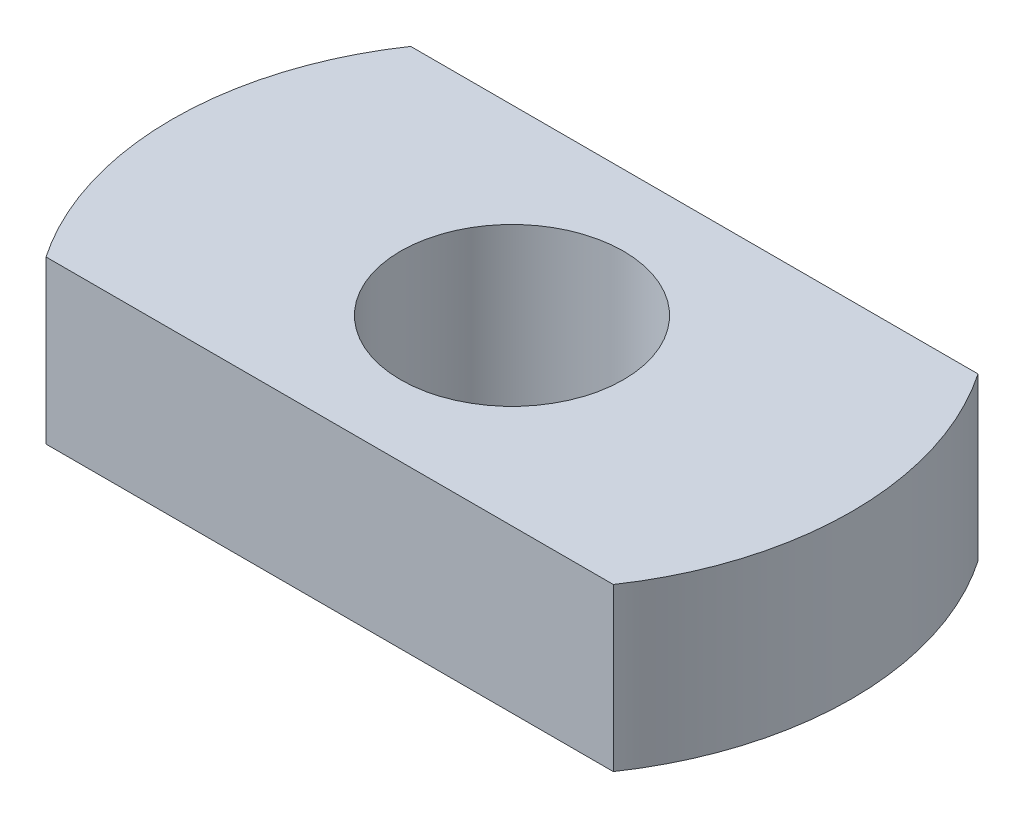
from build123d import *

# Parameters (mm, degrees)
SKETCH1_R      = 27.5
EXTRUDE1_DEPTH = 40


with BuildPart() as part:
    # Sketch1 → Extrude1 (new body)
    with BuildSketch(Plane(origin=(0, 0, 0), x_dir=(1, 0, 0), z_dir=(0, 1, 0))):
        with BuildLine():
            Line((-70, 45), (70, 45))
            ThreePointArc((70, 45), (83.856217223, 0), (70, -45))
            Line((70, -45), (-70, -45))
            ThreePointArc((-70, -45), (-83.856217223, 0), (-70, 45))
        make_face()
        with Locations(Location((0, 0, 0), (0, 0, 270))):
            Circle(SKETCH1_R, mode=Mode.SUBTRACT)
    extrude(amount=EXTRUDE1_DEPTH)


solid = part.part
